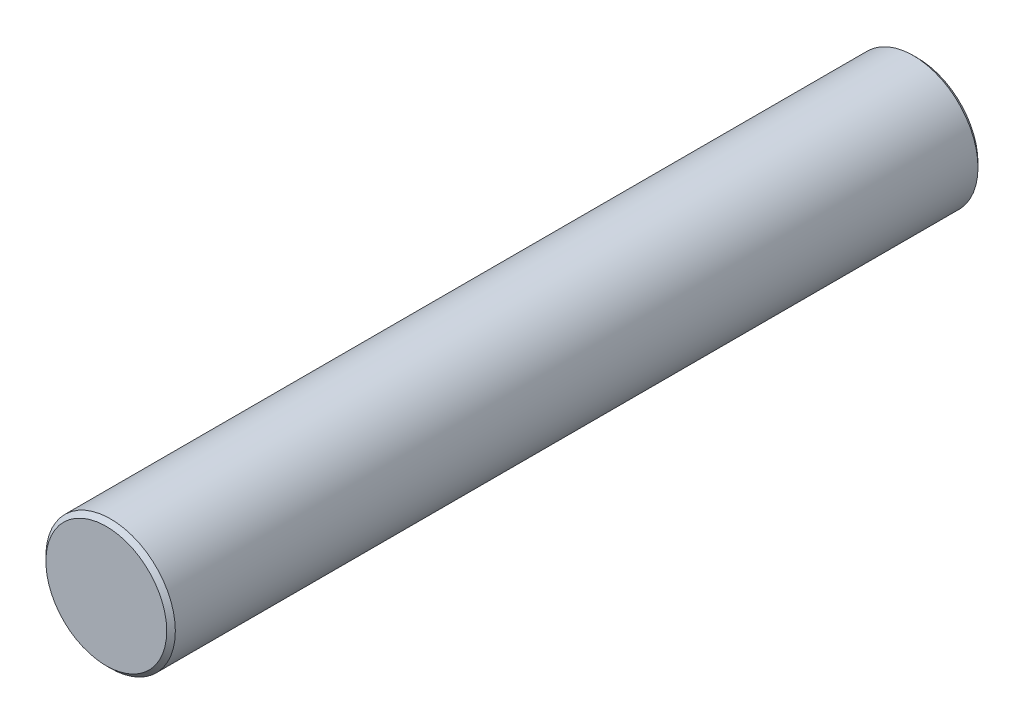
from build123d import *

# Parameters (mm, degrees)
ESQUISSE1_R           = 3
CORPS_DEPTH           = 37.6
TROU_TARAUD_M31_D     = 2.5
TROU_TARAUD_M31_DEPTH = 7.5
TROU_TARAUD_M31_TIP   = 0.751075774
CHANFREIN1_SIZE       = 0.2


with BuildPart() as part:
    # Esquisse1 → corps (new body)
    with BuildSketch(Plane.XY):
        Circle(ESQUISSE1_R)
    extrude(amount=CORPS_DEPTH)

    # Trou taraud_ M31
    with Locations(Plane(origin=(0, 0, 0), x_dir=(-1, 0, 0), z_dir=(0, 0, -1))):
        with Locations((0, 0)):
            Hole(TROU_TARAUD_M31_D / 2, depth=TROU_TARAUD_M31_DEPTH)
            with Locations((0, 0, -(TROU_TARAUD_M31_DEPTH + TROU_TARAUD_M31_TIP / 2))):  # 118° drill point
                Cone(0, TROU_TARAUD_M31_D / 2, TROU_TARAUD_M31_TIP, mode=Mode.SUBTRACT)

    # Chanfrein1
    chanfrein1_edges = [part.edges().sort_by_distance(p)[0] for p in [
        (-3, 0, 0),
        (-3, 0, 37.6),
    ]]
    chamfer(chanfrein1_edges, length=CHANFREIN1_SIZE)


solid = part.part
